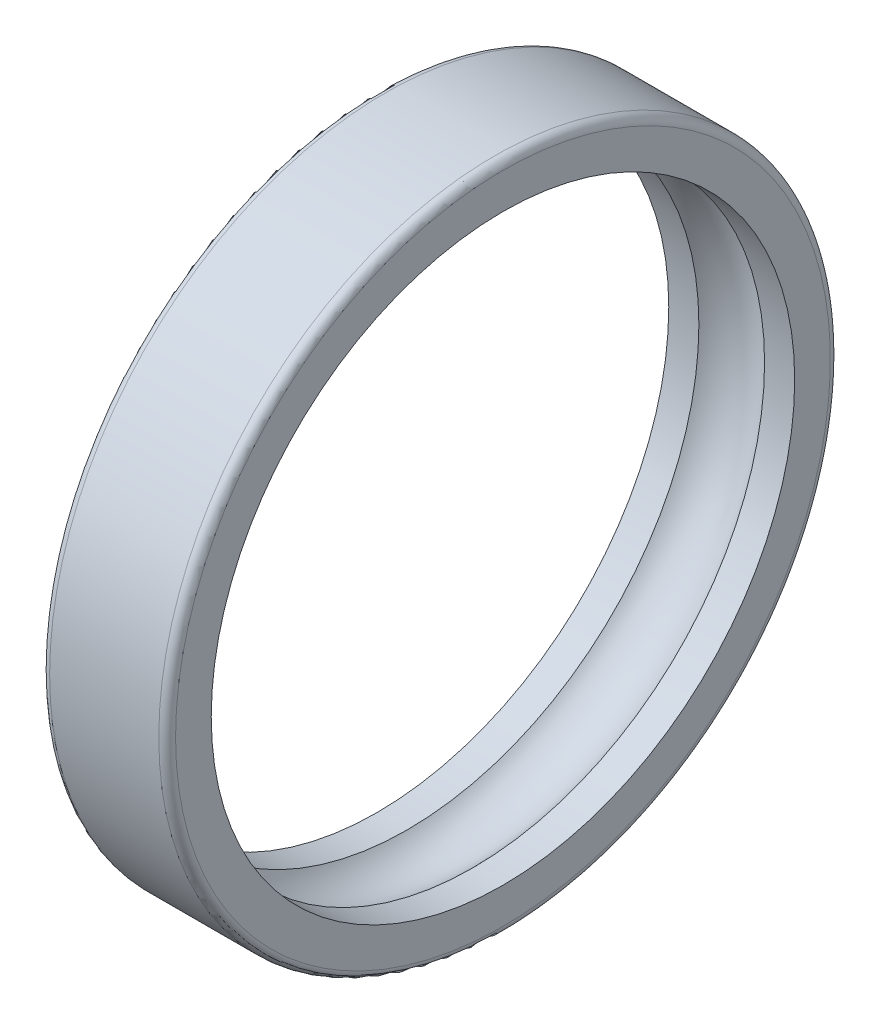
from build123d import *


with BuildPart() as part:
    # Esquisse1 → Base-R_volution (revolve)
    with BuildSketch(Plane(origin=(0, 0, 0), x_dir=(1, 0, 0), z_dir=(0, 1, 0)), mode=Mode.PRIVATE) as base_r_volution_sk:
        with BuildLine():
            Line((0, 78), (0, 69.5))
            Line((0, 69.5), (7.173762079, 69.5))
            ThreePointArc((7.173762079, 69.5), (15, 73), (22.826237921, 69.5))
            Line((22.826237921, 69.5), (30, 69.5))
            Line((30, 69.5), (30, 78))
            ThreePointArc((30, 78), (29.414213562, 79.414213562), (28, 80))
            Line((28, 80), (2, 80))
            ThreePointArc((2, 80), (0.585786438, 79.414213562), (0, 78))
        make_face()
    revolve(base_r_volution_sk.sketch.rotate(Axis((0, 0, 0), (1, 0, 0)), 180), axis=Axis((0, 0, 0), (1, 0, 0)))


solid = part.part
